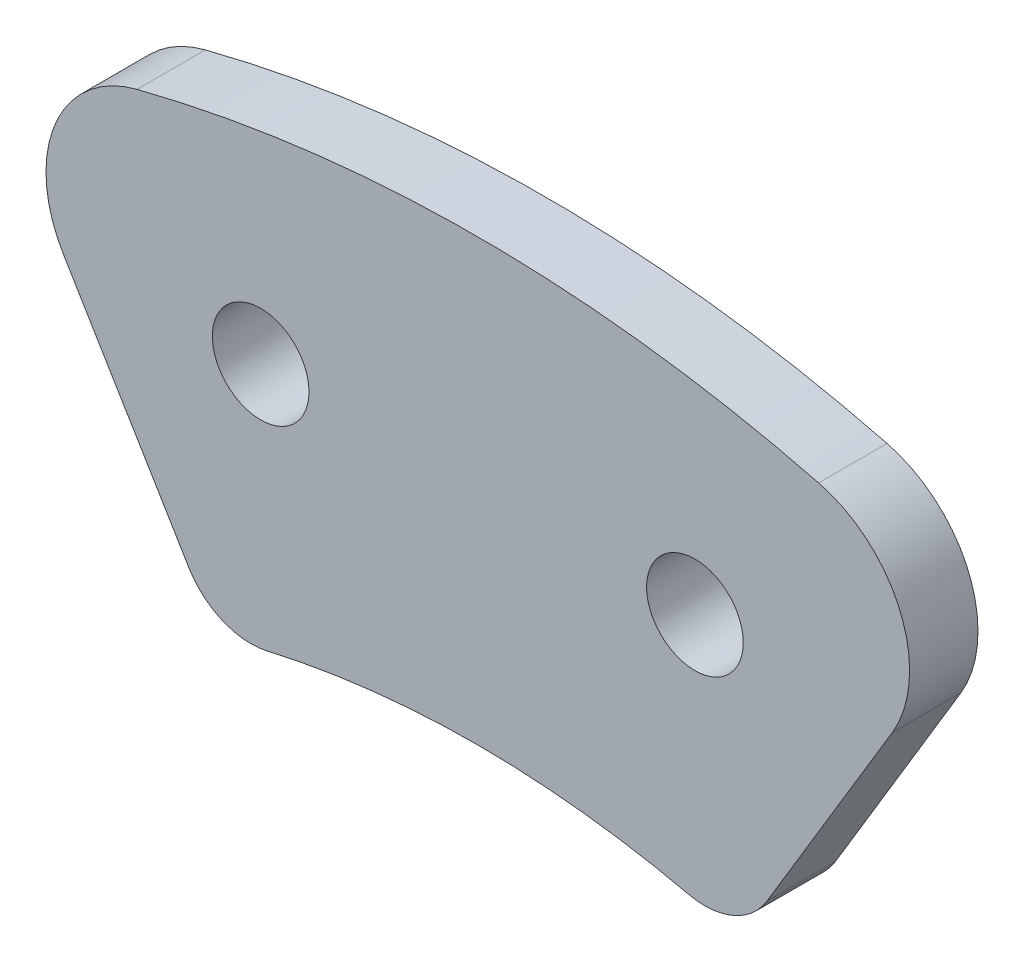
from build123d import *

# Parameters (mm, degrees)
SKETCH_2_R      = 1.06
EXTRUDE_1_DEPTH = 0.75
FILLET_1_R      = 2.65
FILLET_2_R      = 1.59


with BuildPart() as part:
    # Sketch 2 → Extrude 1 (new, symmetric)
    with BuildSketch(Plane.XY):
        with BuildLine():
            Line((5.730721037, 19.810931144), (8.300141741, 24.087165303))
            Line((8.300141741, 24.087165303), (10.818460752, 28.278351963))
            ThreePointArc((10.818460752, 28.278351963), (0, 30.277124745), (-10.818460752, 28.278351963))
            Line((-10.818460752, 28.278351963), (-5.730721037, 19.810931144))
            ThreePointArc((-5.730721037, 19.810931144), (0, 20.623146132), (5.730721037, 19.810931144))
        make_face()
        with Locations((-4.7625, 25.477124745)):
            Circle(SKETCH_2_R, mode=Mode.SUBTRACT)
        with Locations((4.7625, 25.477124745)):
            Circle(SKETCH_2_R, mode=Mode.SUBTRACT)
    extrude(amount=EXTRUDE_1_DEPTH, both=True)

    # Fillet 1
    fillet_1_edges = [part.edges().sort_by_distance(p)[0] for p in [
        (-10.818460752, 28.278351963, 0),
        (10.818460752, 28.278351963, 0),
    ]]
    fillet(fillet_1_edges, radius=FILLET_1_R)

    # Fillet 2
    fillet_2_edges = [part.edges().sort_by_distance(p)[0] for p in [
        (-5.730721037, 19.810931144, 0),
        (5.730721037, 19.810931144, 0),
    ]]
    fillet(fillet_2_edges, radius=FILLET_2_R)


solid = part.part
